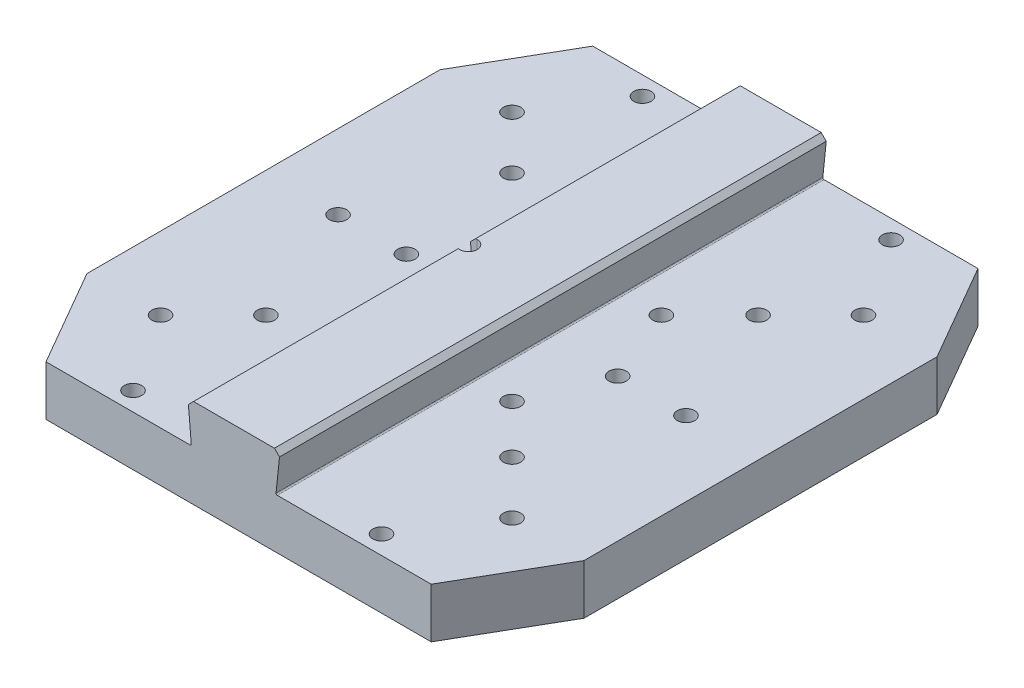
from build123d import *
from OCP.BRepFilletAPI import BRepFilletAPI_MakeChamfer

# Parameters (mm, degrees)
ESQUISSE1_W                    = 400
ESQUISSE1_H                    = 440
BOSS_EXTRU_1_DEPTH             = 40.2
CHANFREIN1_SIZE                = 45
CHANFREIN1_SIZE2               = 77.942286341
BOSS_EXTRU_2_REACH             = 302.027
BOSS_EXTRU_2_DIRECTION_2_REACH = 302.027
ENL_V_MAT_EXTRU_1_DEPTH        = 31.7
CHANFREIN2_SIZE                = 4.5
CHANFREIN2_SIZE2               = 4.153780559
CHANFREIN2_SIZE2_2             = 4.094443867
CONG_1_R                       = 1
TROU_TARAUD_M161_D             = 14
TROU_TARAUD_M161_CSINK_D       = 16.05
TROU_TARAUD_M161_CSINK_ANGLE   = 90
TROU_TARAUD_M162_D             = 14
TROU_TARAUD_M162_DEPTH         = 42
TROU_TARAUD_M162_CSINK_D       = 16.05
TROU_TARAUD_M162_CSINK_ANGLE   = 90
TROU_TARAUD_M162_TIP           = 4.206024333


with BuildPart() as part:
    # Esquisse1 → Boss.-Extru.1 (new body)
    with BuildSketch(Plane(origin=(0, 0, 0), x_dir=(1, 0, 0), z_dir=(0, 1, 0))):
        Rectangle(ESQUISSE1_W, ESQUISSE1_H)
    extrude(amount=-BOSS_EXTRU_1_DEPTH)

    # Chanfrein1: one chamfer whose edges measure the first distance from different faces: ONE call of the kernel's chamfer builder (chamfer() names one face for all edges)
    chanfrein1_edges_1 = [part.edges().sort_by_distance(p)[0] for p in [
        (200, -20.1, 220),
        (-200, -20.1, 220),
    ]]
    chanfrein1_side_1 = [part.faces().sort_by_distance(p)[0] for p in [
        (0, -20.1, 220),
    ]]
    chanfrein1_edges_2 = [part.edges().sort_by_distance(p)[0] for p in [
        (-200, -20.1, -220),
        (200, -20.1, -220),
    ]]
    chanfrein1_side_2 = [part.faces().sort_by_distance(p)[0] for p in [
        (0, -20.1, -220),
    ]]
    chanfrein1 = BRepFilletAPI_MakeChamfer(part.part.solid().wrapped)
    for e in chanfrein1_edges_1:
        chanfrein1.Add(CHANFREIN1_SIZE, CHANFREIN1_SIZE2, e.wrapped, chanfrein1_side_1[0].wrapped)  # the first distance lies on this face
    for e in chanfrein1_edges_2:
        chanfrein1.Add(CHANFREIN1_SIZE, CHANFREIN1_SIZE2, e.wrapped, chanfrein1_side_2[0].wrapped)  # the first distance lies on this face
    add(Compound.cast(chanfrein1.Shape()), mode=Mode.REPLACE)

    # Boss.-Extru.2: up to this face of the body (flat: up to its plane)
    boss_extru_2_end = Plane(part.part.faces().sort_by_distance((0, -20.1, 220))[0])
    # Esquisse2 → Boss.-Extru.2 (add, up to the picked face)
    with BuildSketch(Plane.XY, mode=Mode.PRIVATE) as boss_extru_2_sk1:
        Polygon((-38, 0), (-40.773390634, 31.7), (33.331804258, 31.7), (30, 0), align=None)
    boss_extru_2_tool1 = split(extrude(boss_extru_2_sk1.sketch, amount=BOSS_EXTRU_2_REACH, mode=Mode.PRIVATE), bisect_by=boss_extru_2_end, keep=Keep.BOTH, mode=Mode.PRIVATE)
    add(boss_extru_2_tool1.solids().sort_by(Axis((-3.858397, 16.076985, 0), (0, 0, 1)))[0])

    # Boss.-Extru.2 direction 2: up to this face of the body (flat: up to its plane)
    boss_extru_2_direction_2_end = Plane(part.part.faces().sort_by_distance((0, -20.1, -220))[0])
    # Esquisse2 → Boss.-Extru.2 direction 2 (add, up to the picked face)
    with BuildSketch(Plane.XY, mode=Mode.PRIVATE) as boss_extru_2_direction_2_sk1:
        Polygon((-38, 0), (-40.773390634, 31.7), (33.331804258, 31.7), (30, 0), align=None)
    boss_extru_2_direction_2_tool1 = split(extrude(boss_extru_2_direction_2_sk1.sketch, amount=-BOSS_EXTRU_2_DIRECTION_2_REACH, mode=Mode.PRIVATE), bisect_by=boss_extru_2_direction_2_end, keep=Keep.BOTH, mode=Mode.PRIVATE)
    add(boss_extru_2_direction_2_tool1.solids().sort_by(Axis((-3.858397, 16.076985, 0), (0, 0, -1)))[0])

    # Esquisse3 → Enl_v. mat.-Extru.1 (cut)
    with BuildSketch(Plane(origin=(0, 31.7, 0), x_dir=(1, 0, 0), z_dir=(0, 1, 0))):
        with BuildLine():
            Line((-46.546781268, 7), (-35, 7))
            ThreePointArc((-35, 7), (-28, 0), (-35, -7))
            Line((-35, -7), (-46.546781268, -7))
            ThreePointArc((-46.546781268, -7), (-53.546781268, 0), (-46.546781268, 7))
        make_face()
    extrude(amount=-ENL_V_MAT_EXTRU_1_DEPTH, mode=Mode.SUBTRACT)

    # Chanfrein2: one chamfer whose edges measure the first distance from different faces: ONE call of the kernel's chamfer builder (chamfer() names one face for all edges)
    chanfrein2_edges_1 = [part.edges().sort_by_distance(p)[0] for p in [
        (-40.773390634, 31.7, -113.5),
        (-40.773390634, 31.7, 113.5),
    ]]
    chanfrein2_side_1 = [part.faces().sort_by_distance(p)[0] for p in [
        (-3.568539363, 31.7, 0),
    ]]
    chanfrein2_edges_2 = [part.edges().sort_by_distance(p)[0] for p in [
        (33.331804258, 31.7, 0),
    ]]
    chanfrein2_side_2 = [part.faces().sort_by_distance(p)[0] for p in [
        (-3.568539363, 31.7, 0),
    ]]
    chanfrein2 = BRepFilletAPI_MakeChamfer(part.part.solid().wrapped)
    for e in chanfrein2_edges_1:
        chanfrein2.Add(CHANFREIN2_SIZE, CHANFREIN2_SIZE2, e.wrapped, chanfrein2_side_1[0].wrapped)  # the first distance lies on this face
    for e in chanfrein2_edges_2:
        chanfrein2.Add(CHANFREIN2_SIZE, CHANFREIN2_SIZE2_2, e.wrapped, chanfrein2_side_2[0].wrapped)  # the first distance lies on this face
    add(Compound.cast(chanfrein2.Shape()), mode=Mode.REPLACE)

    # Cong_1
    cong_1_edges = [part.edges().sort_by_distance(p)[0] for p in [
        (-38, 0, -113.5),
        (-38, 0, 113.5),
        (30, 0, 0),
    ]]
    fillet(cong_1_edges, radius=CONG_1_R)

    # Trou taraud_ M161 (through all)
    with Locations(Plane(origin=(0, -40.2, 0), x_dir=(-1, 0, 0), z_dir=(0, -1, 0))):
        with Locations((-100, -205), (-141.421356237, -141.421356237), (-98.994949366, -98.994949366), (-60.104076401, -60.104076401), (-85, 0), (-140, 0), (-60.104076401, 60.104076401), (-98.994949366, 98.994949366), (-141.421356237, 141.421356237), (-100, 205), (100, 205), (141.421356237, 141.421356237), (98.994949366, 98.994949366), (60.104076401, 60.104076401), (140, 0), (85, 0), (60.104076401, -60.104076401), (98.994949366, -98.994949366), (141.421356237, -141.421356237), (100, -205)):
            CounterSinkHole(TROU_TARAUD_M161_D / 2, TROU_TARAUD_M161_CSINK_D / 2, counter_sink_angle=TROU_TARAUD_M161_CSINK_ANGLE)

    # Trou taraud_ M162
    with Locations(Plane(origin=(0, -40.2, 0), x_dir=(-1, 0, 0), z_dir=(0, -1, 0))):
        with Locations((0, -200), (0, -140), (0, -85), (0, 85), (0, 140), (0, 200)):
            CounterSinkHole(TROU_TARAUD_M162_D / 2, TROU_TARAUD_M162_CSINK_D / 2, depth=TROU_TARAUD_M162_DEPTH, counter_sink_angle=TROU_TARAUD_M162_CSINK_ANGLE)
            with Locations((0, 0, -(TROU_TARAUD_M162_DEPTH + TROU_TARAUD_M162_TIP / 2))):  # 118° drill point
                Cone(0, TROU_TARAUD_M162_D / 2, TROU_TARAUD_M162_TIP, mode=Mode.SUBTRACT)


solid = part.part
